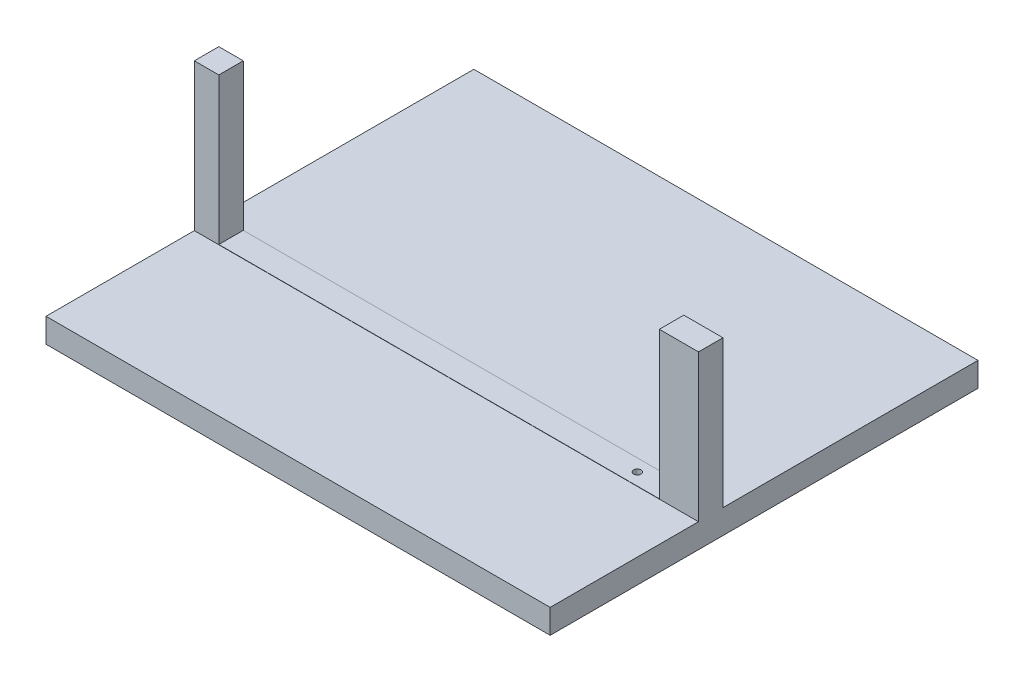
ISO-10303-21;
HEADER;
FILE_DESCRIPTION(('STEP AP214'),'2;1');
FILE_NAME('part.step','',(''),(''),'','','');
FILE_SCHEMA(('AUTOMOTIVE_DESIGN { 1 0 10303 214 1 1 1 1 }'));
ENDSEC;
DATA;
#1=APPLICATION_CONTEXT('core data for automotive mechanical design processes');
#2=APPLICATION_PROTOCOL_DEFINITION('international standard','automotive_design',2000,#1);
#3=PRODUCT_CONTEXT('',#1,'mechanical');
#4=PRODUCT('Part','Part','',(#3));
#5=PRODUCT_RELATED_PRODUCT_CATEGORY('part','',(#4));
#6=PRODUCT_DEFINITION_FORMATION('','',#4);
#7=PRODUCT_DEFINITION_CONTEXT('part definition',#1,'design');
#8=PRODUCT_DEFINITION('design','',#6,#7);
#9=PRODUCT_DEFINITION_SHAPE('','',#8);
#10=(LENGTH_UNIT() NAMED_UNIT(*) SI_UNIT(.MILLI.,.METRE.));
#11=(NAMED_UNIT(*) PLANE_ANGLE_UNIT() SI_UNIT($,.RADIAN.));
#12=(NAMED_UNIT(*) SI_UNIT($,.STERADIAN.) SOLID_ANGLE_UNIT());
#13=UNCERTAINTY_MEASURE_WITH_UNIT(LENGTH_MEASURE(1.E-05),#10,'distance_accuracy_value','');
#14=(GEOMETRIC_REPRESENTATION_CONTEXT(3) GLOBAL_UNCERTAINTY_ASSIGNED_CONTEXT((#13)) GLOBAL_UNIT_ASSIGNED_CONTEXT((#10,
#11,#12)) REPRESENTATION_CONTEXT('',''));
#15=CARTESIAN_POINT('',(0.,0.,0.));
#16=DIRECTION('',(0.,0.,1.));
#17=DIRECTION('',(1.,0.,0.));
#18=AXIS2_PLACEMENT_3D('',#15,#16,#17);
#19=CARTESIAN_POINT('',(0.,0.,50.0000000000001));
#20=DIRECTION('',(0.,1.,0.));
#21=DIRECTION('',(0.,0.,1.));
#22=AXIS2_PLACEMENT_3D('',#19,#20,#21);
#23=PLANE('',#22);
#24=CARTESIAN_POINT('',(880.,0.,25.0000000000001));
#25=DIRECTION('',(0.,1.,0.));
#26=DIRECTION('',(0.,0.,1.));
#27=AXIS2_PLACEMENT_3D('',#24,#25,#26);
#28=CIRCLE('',#27,7.49999999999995);
#29=CARTESIAN_POINT('',(880.,0.,32.5));
#30=VERTEX_POINT('',#29);
#31=EDGE_CURVE('E153',#30,#30,#28,.T.);
#32=ORIENTED_EDGE('',*,*,#31,.F.);
#33=EDGE_LOOP('',(#32));
#34=FACE_BOUND('',#33,.T.);
#35=DIRECTION('',(-1.,0.,0.));
#36=VECTOR('',#35,1.);
#37=CARTESIAN_POINT('',(0.,0.,50.0000000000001));
#38=LINE('',#37,#36);
#39=CARTESIAN_POINT('',(950.,0.,50.0000000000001));
#40=VERTEX_POINT('',#39);
#41=CARTESIAN_POINT('',(50.,0.,50.0000000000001));
#42=VERTEX_POINT('',#41);
#43=EDGE_CURVE('E39',#40,#42,#38,.T.);
#44=ORIENTED_EDGE('',*,*,#43,.F.);
#45=DIRECTION('',(0.,0.,1.));
#46=VECTOR('',#45,1.);
#47=CARTESIAN_POINT('',(950.,0.,50.0000000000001));
#48=LINE('',#47,#46);
#49=CARTESIAN_POINT('',(950.,0.,0.));
#50=VERTEX_POINT('',#49);
#51=EDGE_CURVE('E183',#50,#40,#48,.T.);
#52=ORIENTED_EDGE('',*,*,#51,.F.);
#53=DIRECTION('',(1.,0.,0.));
#54=VECTOR('',#53,1.);
#55=CARTESIAN_POINT('',(0.,0.,0.));
#56=LINE('',#55,#54);
#57=CARTESIAN_POINT('',(50.,0.,0.));
#58=VERTEX_POINT('',#57);
#59=EDGE_CURVE('E200',#58,#50,#56,.T.);
#60=ORIENTED_EDGE('',*,*,#59,.F.);
#61=DIRECTION('',(0.,0.,-1.));
#62=VECTOR('',#61,1.);
#63=CARTESIAN_POINT('',(50.,0.,50.));
#64=LINE('',#63,#62);
#65=EDGE_CURVE('E11',#42,#58,#64,.T.);
#66=ORIENTED_EDGE('',*,*,#65,.F.);
#67=EDGE_LOOP('',(#44,#52,#60,#66));
#68=FACE_BOUND('',#67,.T.);
#69=ADVANCED_FACE('F35',(#34,#68),#23,.T.);
#70=CARTESIAN_POINT('',(0.,0.,50.));
#71=DIRECTION('',(1.,0.,0.));
#72=DIRECTION('',(0.,0.,-1.));
#73=AXIS2_PLACEMENT_3D('',#70,#71,#72);
#74=PLANE('',#73);
#75=DIRECTION('',(0.,-1.,0.));
#76=VECTOR('',#75,1.);
#77=CARTESIAN_POINT('',(0.,0.,0.));
#78=LINE('',#77,#76);
#79=CARTESIAN_POINT('',(0.,300.,0.));
#80=VERTEX_POINT('',#79);
#81=CARTESIAN_POINT('',(0.,-0.5,0.));
#82=VERTEX_POINT('',#81);
#83=EDGE_CURVE('E210',#80,#82,#78,.T.);
#84=ORIENTED_EDGE('',*,*,#83,.T.);
#85=DIRECTION('',(0.,0.,-1.));
#86=VECTOR('',#85,1.);
#87=CARTESIAN_POINT('',(0.,-0.5,353.));
#88=LINE('',#87,#86);
#89=CARTESIAN_POINT('',(0.,-0.5,-521.000000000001));
#90=VERTEX_POINT('',#89);
#91=EDGE_CURVE('E166',#82,#90,#88,.T.);
#92=ORIENTED_EDGE('',*,*,#91,.T.);
#93=DIRECTION('',(0.,-1.,0.));
#94=VECTOR('',#93,1.);
#95=CARTESIAN_POINT('',(0.,-0.5,-521.000000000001));
#96=LINE('',#95,#94);
#97=CARTESIAN_POINT('',(0.,-50.,-521.000000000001));
#98=VERTEX_POINT('',#97);
#99=EDGE_CURVE('E175',#90,#98,#96,.T.);
#100=ORIENTED_EDGE('',*,*,#99,.T.);
#101=DIRECTION('',(0.,0.,-1.));
#102=VECTOR('',#101,1.);
#103=CARTESIAN_POINT('',(0.,-50.,0.));
#104=LINE('',#103,#102);
#105=CARTESIAN_POINT('',(0.,-50.,353.));
#106=VERTEX_POINT('',#105);
#107=EDGE_CURVE('E138',#106,#98,#104,.T.);
#108=ORIENTED_EDGE('',*,*,#107,.F.);
#109=DIRECTION('',(0.,-1.,0.));
#110=VECTOR('',#109,1.);
#111=CARTESIAN_POINT('',(0.,-0.5,353.));
#112=LINE('',#111,#110);
#113=CARTESIAN_POINT('',(0.,-0.5,353.));
#114=VERTEX_POINT('',#113);
#115=EDGE_CURVE('E148',#114,#106,#112,.T.);
#116=ORIENTED_EDGE('',*,*,#115,.F.);
#117=CARTESIAN_POINT('',(0.,-0.5,50.));
#118=VERTEX_POINT('',#117);
#119=EDGE_CURVE('E167',#114,#118,#88,.T.);
#120=ORIENTED_EDGE('',*,*,#119,.T.);
#121=DIRECTION('',(0.,-1.,0.));
#122=VECTOR('',#121,1.);
#123=CARTESIAN_POINT('',(0.,0.,50.));
#124=LINE('',#123,#122);
#125=CARTESIAN_POINT('',(0.,300.,50.));
#126=VERTEX_POINT('',#125);
#127=EDGE_CURVE('E216',#126,#118,#124,.T.);
#128=ORIENTED_EDGE('',*,*,#127,.F.);
#129=DIRECTION('',(0.,0.,-1.));
#130=VECTOR('',#129,1.);
#131=CARTESIAN_POINT('',(0.,300.,50.));
#132=LINE('',#131,#130);
#133=EDGE_CURVE('E219',#126,#80,#132,.T.);
#134=ORIENTED_EDGE('',*,*,#133,.T.);
#135=EDGE_LOOP('',(#84,#92,#100,#108,#116,#120,#128,#134));
#136=FACE_BOUND('',#135,.T.);
#137=ADVANCED_FACE('F37',(#136),#74,.F.);
#138=CARTESIAN_POINT('',(50.,0.,50.));
#139=DIRECTION('',(-1.,0.,0.));
#140=DIRECTION('',(0.,0.,1.));
#141=AXIS2_PLACEMENT_3D('',#138,#139,#140);
#142=PLANE('',#141);
#143=DIRECTION('',(0.,1.,0.));
#144=VECTOR('',#143,1.);
#145=CARTESIAN_POINT('',(50.,0.,0.));
#146=LINE('',#145,#144);
#147=CARTESIAN_POINT('',(50.,300.,0.));
#148=VERTEX_POINT('',#147);
#149=EDGE_CURVE('E213',#58,#148,#146,.T.);
#150=ORIENTED_EDGE('',*,*,#149,.T.);
#151=DIRECTION('',(0.,0.,-1.));
#152=VECTOR('',#151,1.);
#153=CARTESIAN_POINT('',(50.,300.,50.));
#154=LINE('',#153,#152);
#155=CARTESIAN_POINT('',(50.,300.,50.));
#156=VERTEX_POINT('',#155);
#157=EDGE_CURVE('E45',#156,#148,#154,.T.);
#158=ORIENTED_EDGE('',*,*,#157,.F.);
#159=DIRECTION('',(0.,1.,0.));
#160=VECTOR('',#159,1.);
#161=CARTESIAN_POINT('',(50.,0.,50.));
#162=LINE('',#161,#160);
#163=EDGE_CURVE('E58',#42,#156,#162,.T.);
#164=ORIENTED_EDGE('',*,*,#163,.F.);
#165=ORIENTED_EDGE('',*,*,#65,.T.);
#166=EDGE_LOOP('',(#150,#158,#164,#165));
#167=FACE_BOUND('',#166,.T.);
#168=ADVANCED_FACE('F232',(#167),#142,.F.);
#169=CARTESIAN_POINT('',(0.,300.,50.));
#170=DIRECTION('',(0.,-1.,0.));
#171=DIRECTION('',(0.,0.,-1.));
#172=AXIS2_PLACEMENT_3D('',#169,#170,#171);
#173=PLANE('',#172);
#174=DIRECTION('',(-1.,0.,0.));
#175=VECTOR('',#174,1.);
#176=CARTESIAN_POINT('',(0.,300.,0.));
#177=LINE('',#176,#175);
#178=EDGE_CURVE('E214',#148,#80,#177,.T.);
#179=ORIENTED_EDGE('',*,*,#178,.T.);
#180=ORIENTED_EDGE('',*,*,#133,.F.);
#181=DIRECTION('',(-1.,0.,0.));
#182=VECTOR('',#181,1.);
#183=CARTESIAN_POINT('',(0.,300.,50.));
#184=LINE('',#183,#182);
#185=EDGE_CURVE('E53',#156,#126,#184,.T.);
#186=ORIENTED_EDGE('',*,*,#185,.F.);
#187=ORIENTED_EDGE('',*,*,#157,.T.);
#188=EDGE_LOOP('',(#179,#180,#186,#187));
#189=FACE_BOUND('',#188,.T.);
#190=ADVANCED_FACE('F237',(#189),#173,.F.);
#191=CARTESIAN_POINT('',(0.,300.,50.));
#192=DIRECTION('',(0.,0.,-1.));
#193=DIRECTION('',(-1.,0.,0.));
#194=AXIS2_PLACEMENT_3D('',#191,#192,#193);
#195=PLANE('',#194);
#196=ORIENTED_EDGE('',*,*,#127,.T.);
#197=DIRECTION('',(1.,0.,0.));
#198=VECTOR('',#197,1.);
#199=CARTESIAN_POINT('',(0.,-0.5,50.));
#200=LINE('',#199,#198);
#201=CARTESIAN_POINT('',(1030.,-0.5,50.0000000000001));
#202=VERTEX_POINT('',#201);
#203=EDGE_CURVE('E180',#118,#202,#200,.T.);
#204=ORIENTED_EDGE('',*,*,#203,.T.);
#205=DIRECTION('',(0.,1.,0.));
#206=VECTOR('',#205,1.);
#207=CARTESIAN_POINT('',(1030.,-50.,50.0000000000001));
#208=LINE('',#207,#206);
#209=CARTESIAN_POINT('',(1030.,300.,50.0000000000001));
#210=VERTEX_POINT('',#209);
#211=EDGE_CURVE('E137',#202,#210,#208,.T.);
#212=ORIENTED_EDGE('',*,*,#211,.T.);
#213=DIRECTION('',(1.,0.,0.));
#214=VECTOR('',#213,1.);
#215=CARTESIAN_POINT('',(1030.,300.,50.0000000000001));
#216=LINE('',#215,#214);
#217=CARTESIAN_POINT('',(950.,300.,50.0000000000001));
#218=VERTEX_POINT('',#217);
#219=EDGE_CURVE('E192',#218,#210,#216,.T.);
#220=ORIENTED_EDGE('',*,*,#219,.F.);
#221=DIRECTION('',(0.,-1.,0.));
#222=VECTOR('',#221,1.);
#223=CARTESIAN_POINT('',(950.,300.,50.0000000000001));
#224=LINE('',#223,#222);
#225=EDGE_CURVE('E195',#218,#40,#224,.T.);
#226=ORIENTED_EDGE('',*,*,#225,.T.);
#227=ORIENTED_EDGE('',*,*,#43,.T.);
#228=ORIENTED_EDGE('',*,*,#163,.T.);
#229=ORIENTED_EDGE('',*,*,#185,.T.);
#230=EDGE_LOOP('',(#196,#204,#212,#220,#226,#227,#228,#229));
#231=FACE_BOUND('',#230,.T.);
#232=ADVANCED_FACE('F246',(#231),#195,.F.);
#233=CARTESIAN_POINT('',(0.,300.,0.));
#234=DIRECTION('',(0.,0.,-1.));
#235=DIRECTION('',(-1.,0.,0.));
#236=AXIS2_PLACEMENT_3D('',#233,#234,#235);
#237=PLANE('',#236);
#238=DIRECTION('',(1.,0.,0.));
#239=VECTOR('',#238,1.);
#240=CARTESIAN_POINT('',(0.,-0.5,0.));
#241=LINE('',#240,#239);
#242=CARTESIAN_POINT('',(1030.,-0.5,0.));
#243=VERTEX_POINT('',#242);
#244=EDGE_CURVE('E174',#82,#243,#241,.T.);
#245=ORIENTED_EDGE('',*,*,#244,.F.);
#246=ORIENTED_EDGE('',*,*,#83,.F.);
#247=ORIENTED_EDGE('',*,*,#178,.F.);
#248=ORIENTED_EDGE('',*,*,#149,.F.);
#249=ORIENTED_EDGE('',*,*,#59,.T.);
#250=DIRECTION('',(0.,-1.,0.));
#251=VECTOR('',#250,1.);
#252=CARTESIAN_POINT('',(950.,300.,0.));
#253=LINE('',#252,#251);
#254=CARTESIAN_POINT('',(950.,300.,0.));
#255=VERTEX_POINT('',#254);
#256=EDGE_CURVE('E198',#255,#50,#253,.T.);
#257=ORIENTED_EDGE('',*,*,#256,.F.);
#258=DIRECTION('',(-1.,0.,0.));
#259=VECTOR('',#258,1.);
#260=CARTESIAN_POINT('',(1030.,300.,0.));
#261=LINE('',#260,#259);
#262=CARTESIAN_POINT('',(1030.,300.,0.));
#263=VERTEX_POINT('',#262);
#264=EDGE_CURVE('E188',#263,#255,#261,.T.);
#265=ORIENTED_EDGE('',*,*,#264,.F.);
#266=DIRECTION('',(0.,1.,0.));
#267=VECTOR('',#266,1.);
#268=CARTESIAN_POINT('',(1030.,-50.,0.));
#269=LINE('',#268,#267);
#270=EDGE_CURVE('E208',#243,#263,#269,.T.);
#271=ORIENTED_EDGE('',*,*,#270,.F.);
#272=EDGE_LOOP('',(#245,#246,#247,#248,#249,#257,#265,#271));
#273=FACE_BOUND('',#272,.T.);
#274=ADVANCED_FACE('F240',(#273),#237,.T.);
#275=CARTESIAN_POINT('',(1030.,-50.,0.));
#276=DIRECTION('',(-1.,0.,0.));
#277=DIRECTION('',(0.,0.,1.));
#278=AXIS2_PLACEMENT_3D('',#275,#276,#277);
#279=PLANE('',#278);
#280=ORIENTED_EDGE('',*,*,#211,.F.);
#281=DIRECTION('',(0.,0.,1.));
#282=VECTOR('',#281,1.);
#283=CARTESIAN_POINT('',(1030.,-0.5,0.));
#284=LINE('',#283,#282);
#285=CARTESIAN_POINT('',(1030.,-0.5,353.));
#286=VERTEX_POINT('',#285);
#287=EDGE_CURVE('E144',#202,#286,#284,.T.);
#288=ORIENTED_EDGE('',*,*,#287,.T.);
#289=DIRECTION('',(0.,-1.,0.));
#290=VECTOR('',#289,1.);
#291=CARTESIAN_POINT('',(1030.,-0.5,353.));
#292=LINE('',#291,#290);
#293=CARTESIAN_POINT('',(1030.,-50.,353.));
#294=VERTEX_POINT('',#293);
#295=EDGE_CURVE('E141',#286,#294,#292,.T.);
#296=ORIENTED_EDGE('',*,*,#295,.T.);
#297=DIRECTION('',(0.,0.,1.));
#298=VECTOR('',#297,1.);
#299=CARTESIAN_POINT('',(1030.,-50.,0.));
#300=LINE('',#299,#298);
#301=CARTESIAN_POINT('',(1030.,-50.,-521.000000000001));
#302=VERTEX_POINT('',#301);
#303=EDGE_CURVE('E127',#302,#294,#300,.T.);
#304=ORIENTED_EDGE('',*,*,#303,.F.);
#305=DIRECTION('',(0.,-1.,0.));
#306=VECTOR('',#305,1.);
#307=CARTESIAN_POINT('',(1030.,-0.5,-521.000000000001));
#308=LINE('',#307,#306);
#309=CARTESIAN_POINT('',(1030.,-0.5,-521.000000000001));
#310=VERTEX_POINT('',#309);
#311=EDGE_CURVE('E172',#310,#302,#308,.T.);
#312=ORIENTED_EDGE('',*,*,#311,.F.);
#313=EDGE_CURVE('E161',#310,#243,#284,.T.);
#314=ORIENTED_EDGE('',*,*,#313,.T.);
#315=ORIENTED_EDGE('',*,*,#270,.T.);
#316=DIRECTION('',(0.,0.,-1.));
#317=VECTOR('',#316,1.);
#318=CARTESIAN_POINT('',(1030.,300.,50.0000000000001));
#319=LINE('',#318,#317);
#320=EDGE_CURVE('E185',#210,#263,#319,.T.);
#321=ORIENTED_EDGE('',*,*,#320,.F.);
#322=EDGE_LOOP('',(#280,#288,#296,#304,#312,#314,#315,#321));
#323=FACE_BOUND('',#322,.T.);
#324=ADVANCED_FACE('F143',(#323),#279,.F.);
#325=CARTESIAN_POINT('',(0.,-50.,50.0000000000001));
#326=DIRECTION('',(0.,1.,0.));
#327=DIRECTION('',(0.,0.,1.));
#328=AXIS2_PLACEMENT_3D('',#325,#326,#327);
#329=PLANE('',#328);
#330=CARTESIAN_POINT('',(880.,-50.,25.0000000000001));
#331=DIRECTION('',(0.,1.,0.));
#332=DIRECTION('',(0.,0.,1.));
#333=AXIS2_PLACEMENT_3D('',#330,#331,#332);
#334=CIRCLE('',#333,7.49999999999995);
#335=CARTESIAN_POINT('',(880.,-50.,32.5));
#336=VERTEX_POINT('',#335);
#337=EDGE_CURVE('E157',#336,#336,#334,.T.);
#338=ORIENTED_EDGE('',*,*,#337,.T.);
#339=EDGE_LOOP('',(#338));
#340=FACE_BOUND('',#339,.T.);
#341=ORIENTED_EDGE('',*,*,#107,.T.);
#342=DIRECTION('',(1.,0.,0.));
#343=VECTOR('',#342,1.);
#344=CARTESIAN_POINT('',(1030.,-50.,-521.000000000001));
#345=LINE('',#344,#343);
#346=EDGE_CURVE('E133',#98,#302,#345,.T.);
#347=ORIENTED_EDGE('',*,*,#346,.T.);
#348=ORIENTED_EDGE('',*,*,#303,.T.);
#349=DIRECTION('',(-1.,0.,0.));
#350=VECTOR('',#349,1.);
#351=CARTESIAN_POINT('',(0.,-50.,353.));
#352=LINE('',#351,#350);
#353=EDGE_CURVE('E131',#294,#106,#352,.T.);
#354=ORIENTED_EDGE('',*,*,#353,.T.);
#355=EDGE_LOOP('',(#341,#347,#348,#354));
#356=FACE_BOUND('',#355,.T.);
#357=ADVANCED_FACE('F129',(#340,#356),#329,.F.);
#358=CARTESIAN_POINT('',(950.,300.,50.0000000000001));
#359=DIRECTION('',(1.,0.,0.));
#360=DIRECTION('',(0.,0.,-1.));
#361=AXIS2_PLACEMENT_3D('',#358,#359,#360);
#362=PLANE('',#361);
#363=ORIENTED_EDGE('',*,*,#51,.T.);
#364=ORIENTED_EDGE('',*,*,#225,.F.);
#365=DIRECTION('',(0.,0.,1.));
#366=VECTOR('',#365,1.);
#367=CARTESIAN_POINT('',(950.,300.,50.0000000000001));
#368=LINE('',#367,#366);
#369=EDGE_CURVE('E190',#255,#218,#368,.T.);
#370=ORIENTED_EDGE('',*,*,#369,.F.);
#371=ORIENTED_EDGE('',*,*,#256,.T.);
#372=EDGE_LOOP('',(#363,#364,#370,#371));
#373=FACE_BOUND('',#372,.T.);
#374=ADVANCED_FACE('F258',(#373),#362,.F.);
#375=CARTESIAN_POINT('',(1030.,300.,0.));
#376=DIRECTION('',(0.,1.,0.));
#377=DIRECTION('',(0.,0.,1.));
#378=AXIS2_PLACEMENT_3D('',#375,#376,#377);
#379=PLANE('',#378);
#380=ORIENTED_EDGE('',*,*,#320,.T.);
#381=ORIENTED_EDGE('',*,*,#264,.T.);
#382=ORIENTED_EDGE('',*,*,#369,.T.);
#383=ORIENTED_EDGE('',*,*,#219,.T.);
#384=EDGE_LOOP('',(#380,#381,#382,#383));
#385=FACE_BOUND('',#384,.T.);
#386=ADVANCED_FACE('F260',(#385),#379,.T.);
#387=CARTESIAN_POINT('',(1030.,-0.5,-521.000000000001));
#388=DIRECTION('',(0.,0.,-1.));
#389=DIRECTION('',(-1.,0.,0.));
#390=AXIS2_PLACEMENT_3D('',#387,#388,#389);
#391=PLANE('',#390);
#392=ORIENTED_EDGE('',*,*,#346,.F.);
#393=ORIENTED_EDGE('',*,*,#99,.F.);
#394=DIRECTION('',(1.,0.,0.));
#395=VECTOR('',#394,1.);
#396=CARTESIAN_POINT('',(1030.,-0.5,-521.000000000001));
#397=LINE('',#396,#395);
#398=EDGE_CURVE('E149',#90,#310,#397,.T.);
#399=ORIENTED_EDGE('',*,*,#398,.T.);
#400=ORIENTED_EDGE('',*,*,#311,.T.);
#401=EDGE_LOOP('',(#392,#393,#399,#400));
#402=FACE_BOUND('',#401,.T.);
#403=ADVANCED_FACE('F262',(#402),#391,.T.);
#404=CARTESIAN_POINT('',(1030.,-0.5,353.));
#405=DIRECTION('',(0.,1.,0.));
#406=DIRECTION('',(0.,0.,1.));
#407=AXIS2_PLACEMENT_3D('',#404,#405,#406);
#408=PLANE('',#407);
#409=ORIENTED_EDGE('',*,*,#91,.F.);
#410=ORIENTED_EDGE('',*,*,#244,.T.);
#411=ORIENTED_EDGE('',*,*,#313,.F.);
#412=ORIENTED_EDGE('',*,*,#398,.F.);
#413=EDGE_LOOP('',(#409,#410,#411,#412));
#414=FACE_BOUND('',#413,.T.);
#415=ADVANCED_FACE('F268',(#414),#408,.T.);
#416=ORIENTED_EDGE('',*,*,#203,.F.);
#417=ORIENTED_EDGE('',*,*,#119,.F.);
#418=DIRECTION('',(-1.,0.,0.));
#419=VECTOR('',#418,1.);
#420=CARTESIAN_POINT('',(0.,-0.5,353.));
#421=LINE('',#420,#419);
#422=EDGE_CURVE('E164',#286,#114,#421,.T.);
#423=ORIENTED_EDGE('',*,*,#422,.F.);
#424=ORIENTED_EDGE('',*,*,#287,.F.);
#425=EDGE_LOOP('',(#416,#417,#423,#424));
#426=FACE_BOUND('',#425,.T.);
#427=ADVANCED_FACE('F342',(#426),#408,.T.);
#428=CARTESIAN_POINT('',(0.,-0.5,353.));
#429=DIRECTION('',(0.,0.,1.));
#430=DIRECTION('',(1.,0.,0.));
#431=AXIS2_PLACEMENT_3D('',#428,#429,#430);
#432=PLANE('',#431);
#433=ORIENTED_EDGE('',*,*,#353,.F.);
#434=ORIENTED_EDGE('',*,*,#295,.F.);
#435=ORIENTED_EDGE('',*,*,#422,.T.);
#436=ORIENTED_EDGE('',*,*,#115,.T.);
#437=EDGE_LOOP('',(#433,#434,#435,#436));
#438=FACE_BOUND('',#437,.T.);
#439=ADVANCED_FACE('F152',(#438),#432,.T.);
#440=CARTESIAN_POINT('',(880.,-50.,25.0000000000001));
#441=DIRECTION('',(0.,1.,0.));
#442=DIRECTION('',(0.,0.,1.));
#443=AXIS2_PLACEMENT_3D('',#440,#441,#442);
#444=CYLINDRICAL_SURFACE('',#443,7.49999999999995);
#445=ORIENTED_EDGE('',*,*,#31,.T.);
#446=EDGE_LOOP('',(#445));
#447=FACE_BOUND('',#446,.T.);
#448=ORIENTED_EDGE('',*,*,#337,.F.);
#449=EDGE_LOOP('',(#448));
#450=FACE_BOUND('',#449,.T.);
#451=ADVANCED_FACE('F359',(#447,#450),#444,.F.);
#452=CLOSED_SHELL('',(#69,#137,#168,#190,#232,#274,#324,#357,#374,#386,#403,#415,#427,#439,#451));
#453=MANIFOLD_SOLID_BREP('B2',#452);
#454=ADVANCED_BREP_SHAPE_REPRESENTATION('',(#18,#453),#14);
#455=SHAPE_DEFINITION_REPRESENTATION(#9,#454);
ENDSEC;
END-ISO-10303-21;
